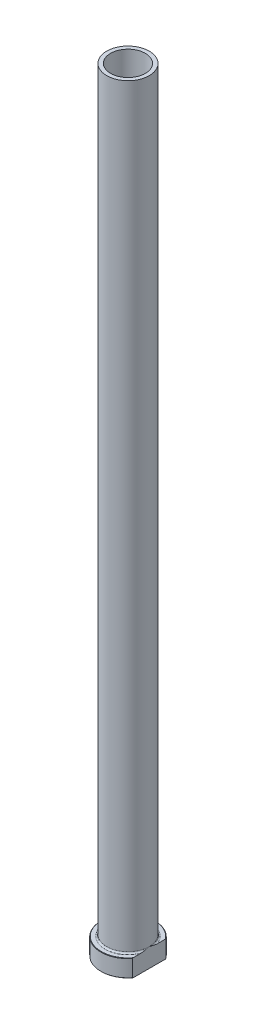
ISO-10303-21;
HEADER;
FILE_DESCRIPTION(('STEP AP214'),'2;1');
FILE_NAME('part.step','',(''),(''),'','','');
FILE_SCHEMA(('AUTOMOTIVE_DESIGN { 1 0 10303 214 1 1 1 1 }'));
ENDSEC;
DATA;
#1=APPLICATION_CONTEXT('core data for automotive mechanical design processes');
#2=APPLICATION_PROTOCOL_DEFINITION('international standard','automotive_design',2000,#1);
#3=PRODUCT_CONTEXT('',#1,'mechanical');
#4=PRODUCT('Part','Part','',(#3));
#5=PRODUCT_RELATED_PRODUCT_CATEGORY('part','',(#4));
#6=PRODUCT_DEFINITION_FORMATION('','',#4);
#7=PRODUCT_DEFINITION_CONTEXT('part definition',#1,'design');
#8=PRODUCT_DEFINITION('design','',#6,#7);
#9=PRODUCT_DEFINITION_SHAPE('','',#8);
#10=(LENGTH_UNIT() NAMED_UNIT(*) SI_UNIT(.MILLI.,.METRE.));
#11=(NAMED_UNIT(*) PLANE_ANGLE_UNIT() SI_UNIT($,.RADIAN.));
#12=(NAMED_UNIT(*) SI_UNIT($,.STERADIAN.) SOLID_ANGLE_UNIT());
#13=UNCERTAINTY_MEASURE_WITH_UNIT(LENGTH_MEASURE(1.E-05),#10,'distance_accuracy_value','');
#14=(GEOMETRIC_REPRESENTATION_CONTEXT(3) GLOBAL_UNCERTAINTY_ASSIGNED_CONTEXT((#13)) GLOBAL_UNIT_ASSIGNED_CONTEXT((#10,
#11,#12)) REPRESENTATION_CONTEXT('',''));
#15=CARTESIAN_POINT('',(0.,0.,0.));
#16=DIRECTION('',(0.,0.,1.));
#17=DIRECTION('',(1.,0.,0.));
#18=AXIS2_PLACEMENT_3D('',#15,#16,#17);
#19=CARTESIAN_POINT('',(0.,92.1876809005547,0.));
#20=DIRECTION('',(0.,1.,0.));
#21=DIRECTION('',(0.,0.,1.));
#22=AXIS2_PLACEMENT_3D('',#19,#20,#21);
#23=CYLINDRICAL_SURFACE('',#22,9.00000000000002);
#24=CARTESIAN_POINT('',(0.,400.,0.));
#25=DIRECTION('',(0.,1.,0.));
#26=DIRECTION('',(0.,0.,1.));
#27=AXIS2_PLACEMENT_3D('',#24,#25,#26);
#28=CIRCLE('',#27,9.00000000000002);
#29=CARTESIAN_POINT('',(0.,400.,9.00000000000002));
#30=VERTEX_POINT('',#29);
#31=EDGE_CURVE('E167',#30,#30,#28,.T.);
#32=ORIENTED_EDGE('',*,*,#31,.T.);
#33=EDGE_LOOP('',(#32));
#34=FACE_BOUND('',#33,.T.);
#35=CARTESIAN_POINT('',(0.,345.,0.));
#36=DIRECTION('',(0.,1.,0.));
#37=DIRECTION('',(0.,0.,1.));
#38=AXIS2_PLACEMENT_3D('',#35,#36,#37);
#39=CIRCLE('',#38,9.00000000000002);
#40=CARTESIAN_POINT('',(0.,345.,9.00000000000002));
#41=VERTEX_POINT('',#40);
#42=EDGE_CURVE('E170',#41,#41,#39,.T.);
#43=ORIENTED_EDGE('',*,*,#42,.F.);
#44=EDGE_LOOP('',(#43));
#45=FACE_BOUND('',#44,.T.);
#46=ADVANCED_FACE('F32',(#34,#45),#23,.F.);
#47=CARTESIAN_POINT('',(-9.00000000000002,400.,0.));
#48=DIRECTION('',(0.,1.,0.));
#49=DIRECTION('',(0.,0.,1.));
#50=AXIS2_PLACEMENT_3D('',#47,#48,#49);
#51=PLANE('',#50);
#52=CARTESIAN_POINT('',(0.,400.,0.));
#53=DIRECTION('',(0.,1.,0.));
#54=DIRECTION('',(0.,0.,1.));
#55=AXIS2_PLACEMENT_3D('',#52,#53,#54);
#56=CIRCLE('',#55,11.);
#57=CARTESIAN_POINT('',(0.,400.,11.));
#58=VERTEX_POINT('',#57);
#59=EDGE_CURVE('E174',#58,#58,#56,.T.);
#60=ORIENTED_EDGE('',*,*,#59,.T.);
#61=EDGE_LOOP('',(#60));
#62=FACE_BOUND('',#61,.T.);
#63=ORIENTED_EDGE('',*,*,#31,.F.);
#64=EDGE_LOOP('',(#63));
#65=FACE_BOUND('',#64,.T.);
#66=ADVANCED_FACE('F157',(#62,#65),#51,.T.);
#67=CARTESIAN_POINT('',(0.,92.1876809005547,0.));
#68=DIRECTION('',(0.,1.,0.));
#69=DIRECTION('',(0.,0.,1.));
#70=AXIS2_PLACEMENT_3D('',#67,#68,#69);
#71=CYLINDRICAL_SURFACE('',#70,11.);
#72=CARTESIAN_POINT('',(0.,9.8,0.));
#73=DIRECTION('',(0.,1.,0.));
#74=DIRECTION('',(0.,0.,1.));
#75=AXIS2_PLACEMENT_3D('',#72,#73,#74);
#76=CIRCLE('',#75,11.);
#77=CARTESIAN_POINT('',(11.,9.8,0.));
#78=VERTEX_POINT('',#77);
#79=EDGE_CURVE('E180',#78,#78,#76,.T.);
#80=ORIENTED_EDGE('',*,*,#79,.T.);
#81=EDGE_LOOP('',(#80));
#82=FACE_BOUND('',#81,.T.);
#83=ORIENTED_EDGE('',*,*,#59,.F.);
#84=EDGE_LOOP('',(#83));
#85=FACE_BOUND('',#84,.T.);
#86=ADVANCED_FACE('F162',(#82,#85),#71,.T.);
#87=CARTESIAN_POINT('',(-11.,9.,0.));
#88=DIRECTION('',(0.,1.,0.));
#89=DIRECTION('',(0.,0.,1.));
#90=AXIS2_PLACEMENT_3D('',#87,#88,#89);
#91=PLANE('',#90);
#92=DIRECTION('',(0.,0.,1.));
#93=VECTOR('',#92,1.);
#94=CARTESIAN_POINT('',(11.,9.,0.));
#95=LINE('',#94,#93);
#96=CARTESIAN_POINT('',(11.,9.,-8.33306666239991));
#97=VERTEX_POINT('',#96);
#98=CARTESIAN_POINT('',(11.,9.,-4.27083130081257));
#99=VERTEX_POINT('',#98);
#100=EDGE_CURVE('E54',#97,#99,#95,.T.);
#101=ORIENTED_EDGE('',*,*,#100,.F.);
#102=CARTESIAN_POINT('',(0.,9.,0.));
#103=DIRECTION('',(0.,1.,0.));
#104=DIRECTION('',(0.,0.,1.));
#105=AXIS2_PLACEMENT_3D('',#102,#103,#104);
#106=CIRCLE('',#105,13.8);
#107=CARTESIAN_POINT('',(11.,9.,8.33306666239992));
#108=VERTEX_POINT('',#107);
#109=EDGE_CURVE('E186',#97,#108,#106,.T.);
#110=ORIENTED_EDGE('',*,*,#109,.T.);
#111=CARTESIAN_POINT('',(11.,9.,4.27083130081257));
#112=VERTEX_POINT('',#111);
#113=EDGE_CURVE('E134',#112,#108,#95,.T.);
#114=ORIENTED_EDGE('',*,*,#113,.F.);
#115=CARTESIAN_POINT('',(0.,9.,0.));
#116=DIRECTION('',(0.,1.,0.));
#117=DIRECTION('',(0.,0.,1.));
#118=AXIS2_PLACEMENT_3D('',#115,#116,#117);
#119=CIRCLE('',#118,11.8);
#120=EDGE_CURVE('E183',#112,#99,#119,.F.);
#121=ORIENTED_EDGE('',*,*,#120,.T.);
#122=EDGE_LOOP('',(#101,#110,#114,#121));
#123=FACE_BOUND('',#122,.T.);
#124=ADVANCED_FACE('F197',(#123),#91,.T.);
#125=CARTESIAN_POINT('',(0.,92.1876809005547,0.));
#126=DIRECTION('',(0.,1.,0.));
#127=DIRECTION('',(0.,0.,1.));
#128=AXIS2_PLACEMENT_3D('',#125,#126,#127);
#129=CYLINDRICAL_SURFACE('',#128,14.);
#130=DIRECTION('',(0.,-1.,0.));
#131=VECTOR('',#130,1.);
#132=CARTESIAN_POINT('',(11.,400.,8.66025403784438));
#133=LINE('',#132,#131);
#134=CARTESIAN_POINT('',(11.,8.80000000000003,8.66025403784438));
#135=VERTEX_POINT('',#134);
#136=CARTESIAN_POINT('',(11.,0.200000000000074,8.66025403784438));
#137=VERTEX_POINT('',#136);
#138=EDGE_CURVE('E82',#135,#137,#133,.T.);
#139=ORIENTED_EDGE('',*,*,#138,.F.);
#140=CARTESIAN_POINT('',(0.,8.80000000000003,0.));
#141=DIRECTION('',(0.,1.,0.));
#142=DIRECTION('',(0.,0.,1.));
#143=AXIS2_PLACEMENT_3D('',#140,#141,#142);
#144=CIRCLE('',#143,14.);
#145=CARTESIAN_POINT('',(11.,8.80000000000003,-8.66025403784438));
#146=VERTEX_POINT('',#145);
#147=EDGE_CURVE('E95',#135,#146,#144,.F.);
#148=ORIENTED_EDGE('',*,*,#147,.T.);
#149=DIRECTION('',(0.,-1.,0.));
#150=VECTOR('',#149,1.);
#151=CARTESIAN_POINT('',(11.,400.,-8.66025403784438));
#152=LINE('',#151,#150);
#153=CARTESIAN_POINT('',(11.,0.200000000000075,-8.66025403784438));
#154=VERTEX_POINT('',#153);
#155=EDGE_CURVE('E192',#146,#154,#152,.T.);
#156=ORIENTED_EDGE('',*,*,#155,.T.);
#157=CARTESIAN_POINT('',(0.,0.200000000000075,0.));
#158=DIRECTION('',(0.,-1.,0.));
#159=DIRECTION('',(0.,0.,-1.));
#160=AXIS2_PLACEMENT_3D('',#157,#158,#159);
#161=CIRCLE('',#160,14.);
#162=EDGE_CURVE('E98',#154,#137,#161,.F.);
#163=ORIENTED_EDGE('',*,*,#162,.T.);
#164=EDGE_LOOP('',(#139,#148,#156,#163));
#165=FACE_BOUND('',#164,.T.);
#166=ADVANCED_FACE('F190',(#165),#129,.T.);
#167=CARTESIAN_POINT('',(-14.,0.,0.));
#168=DIRECTION('',(0.,-1.,0.));
#169=DIRECTION('',(0.,0.,-1.));
#170=AXIS2_PLACEMENT_3D('',#167,#168,#169);
#171=PLANE('',#170);
#172=CARTESIAN_POINT('',(0.,0.,0.));
#173=DIRECTION('',(0.,-1.,0.));
#174=DIRECTION('',(0.,0.,-1.));
#175=AXIS2_PLACEMENT_3D('',#172,#173,#174);
#176=CIRCLE('',#175,9.74999999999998);
#177=CARTESIAN_POINT('',(0.,0.,-9.74999999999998));
#178=VERTEX_POINT('',#177);
#179=EDGE_CURVE('E40',#178,#178,#176,.F.);
#180=ORIENTED_EDGE('',*,*,#179,.T.);
#181=EDGE_LOOP('',(#180));
#182=FACE_BOUND('',#181,.T.);
#183=DIRECTION('',(0.,0.,-1.));
#184=VECTOR('',#183,1.);
#185=CARTESIAN_POINT('',(11.,0.,8.66025403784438));
#186=LINE('',#185,#184);
#187=CARTESIAN_POINT('',(11.,0.,8.33306666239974));
#188=VERTEX_POINT('',#187);
#189=CARTESIAN_POINT('',(11.,0.,-8.33306666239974));
#190=VERTEX_POINT('',#189);
#191=EDGE_CURVE('E47',#188,#190,#186,.T.);
#192=ORIENTED_EDGE('',*,*,#191,.F.);
#193=CARTESIAN_POINT('',(0.,0.,0.));
#194=DIRECTION('',(0.,-1.,0.));
#195=DIRECTION('',(0.,0.,-1.));
#196=AXIS2_PLACEMENT_3D('',#193,#194,#195);
#197=CIRCLE('',#196,13.7999999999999);
#198=EDGE_CURVE('E92',#188,#190,#197,.T.);
#199=ORIENTED_EDGE('',*,*,#198,.T.);
#200=EDGE_LOOP('',(#192,#199));
#201=FACE_BOUND('',#200,.T.);
#202=ADVANCED_FACE('F91',(#182,#201),#171,.T.);
#203=CARTESIAN_POINT('',(0.,92.1876809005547,0.));
#204=DIRECTION('',(0.,1.,0.));
#205=DIRECTION('',(0.,0.,1.));
#206=AXIS2_PLACEMENT_3D('',#203,#204,#205);
#207=CYLINDRICAL_SURFACE('',#206,9.25000000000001);
#208=CARTESIAN_POINT('',(0.,0.499999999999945,0.));
#209=DIRECTION('',(0.,-1.,0.));
#210=DIRECTION('',(0.,0.,-1.));
#211=AXIS2_PLACEMENT_3D('',#208,#209,#210);
#212=CIRCLE('',#211,9.25000000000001);
#213=CARTESIAN_POINT('',(0.,0.499999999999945,-9.25000000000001));
#214=VERTEX_POINT('',#213);
#215=EDGE_CURVE('E11',#214,#214,#212,.T.);
#216=ORIENTED_EDGE('',*,*,#215,.T.);
#217=EDGE_LOOP('',(#216));
#218=FACE_BOUND('',#217,.T.);
#219=CARTESIAN_POINT('',(0.,333.,0.));
#220=DIRECTION('',(0.,1.,0.));
#221=DIRECTION('',(0.,0.,1.));
#222=AXIS2_PLACEMENT_3D('',#219,#220,#221);
#223=CIRCLE('',#222,9.25000000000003);
#224=CARTESIAN_POINT('',(0.,333.,9.25000000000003));
#225=VERTEX_POINT('',#224);
#226=EDGE_CURVE('E172',#225,#225,#223,.T.);
#227=ORIENTED_EDGE('',*,*,#226,.T.);
#228=EDGE_LOOP('',(#227));
#229=FACE_BOUND('',#228,.T.);
#230=ADVANCED_FACE('F215',(#218,#229),#207,.F.);
#231=CARTESIAN_POINT('',(0.,333.,0.));
#232=DIRECTION('',(0.,-1.,0.));
#233=DIRECTION('',(0.,0.,-1.));
#234=AXIS2_PLACEMENT_3D('',#231,#232,#233);
#235=CONICAL_SURFACE('',#234,9.25000000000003,0.0208303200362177);
#236=ORIENTED_EDGE('',*,*,#42,.T.);
#237=EDGE_LOOP('',(#236));
#238=FACE_BOUND('',#237,.T.);
#239=ORIENTED_EDGE('',*,*,#226,.F.);
#240=EDGE_LOOP('',(#239));
#241=FACE_BOUND('',#240,.T.);
#242=ADVANCED_FACE('F111',(#238,#241),#235,.F.);
#243=CARTESIAN_POINT('',(0.,9.8,0.));
#244=DIRECTION('',(0.,1.,0.));
#245=DIRECTION('',(0.,0.,1.));
#246=AXIS2_PLACEMENT_3D('',#243,#244,#245);
#247=TOROIDAL_SURFACE('',#246,11.8,0.8);
#248=ORIENTED_EDGE('',*,*,#120,.F.);
#249=CARTESIAN_POINT('',(11.,9.8,0.));
#250=CARTESIAN_POINT('',(11.,9.8000010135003,-1.16902482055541E-10));
#251=CARTESIAN_POINT('',(11.,9.80000202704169,3.62636934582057E-07));
#252=CARTESIAN_POINT('',(11.,9.80000392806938,1.38767107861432E-06));
#253=CARTESIAN_POINT('',(11.,9.80000479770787,2.0726385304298E-06));
#254=CARTESIAN_POINT('',(11.,9.80000659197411,3.71036788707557E-06));
#255=CARTESIAN_POINT('',(11.,9.80000749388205,4.68930350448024E-06));
#256=CARTESIAN_POINT('',(11.,9.80000912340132,6.73011731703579E-06));
#257=CARTESIAN_POINT('',(11.,9.80000985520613,7.78888300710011E-06));
#258=CARTESIAN_POINT('',(11.,9.80001253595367,1.18457679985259E-05));
#259=CARTESIAN_POINT('',(11.,9.80001433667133,1.49465101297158E-05));
#260=CARTESIAN_POINT('',(11.,9.8000173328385,2.11226793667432E-05));
#261=CARTESIAN_POINT('',(11.,9.80001856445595,2.4181339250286E-05));
#262=CARTESIAN_POINT('',(11.,9.80002366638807,3.70013808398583E-05));
#263=CARTESIAN_POINT('',(11.,9.80002742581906,4.68141787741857E-05));
#264=CARTESIAN_POINT('',(11.,9.80003302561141,6.5442575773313E-05));
#265=CARTESIAN_POINT('',(11.,9.80003506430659,7.41984170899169E-05));
#266=CARTESIAN_POINT('',(11.,9.80004981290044,0.000138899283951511));
#267=CARTESIAN_POINT('',(11.,9.80006088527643,0.000195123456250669));
#268=CARTESIAN_POINT('',(11.,9.80010935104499,0.000417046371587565));
#269=CARTESIAN_POINT('',(11.,9.8001557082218,0.00058074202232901));
#270=CARTESIAN_POINT('',(11.,9.80033600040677,0.00122860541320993));
#271=CARTESIAN_POINT('',(11.,9.80046404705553,0.00171390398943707));
#272=CARTESIAN_POINT('',(11.,9.8009765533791,0.00364143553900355));
#273=CARTESIAN_POINT('',(11.,9.80136837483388,0.00508221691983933));
#274=CARTESIAN_POINT('',(11.,9.80300002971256,0.0110983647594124));
#275=CARTESIAN_POINT('',(11.,9.80423069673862,0.0156755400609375));
#276=CARTESIAN_POINT('',(10.9999999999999,9.82474721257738,0.0919599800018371));
#277=CARTESIAN_POINT('',(11.,9.84411511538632,0.163651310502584));
#278=CARTESIAN_POINT('',(11.,9.88193435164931,0.304144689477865));
#279=CARTESIAN_POINT('',(11.,9.90039088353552,0.372945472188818));
#280=CARTESIAN_POINT('',(11.,9.9395315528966,0.519420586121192));
#281=CARTESIAN_POINT('',(11.,9.96019740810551,0.597099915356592));
#282=CARTESIAN_POINT('',(11.,10.0014716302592,0.753402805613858));
#283=CARTESIAN_POINT('',(11.,10.0220767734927,0.832027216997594));
#284=CARTESIAN_POINT('',(11.,10.0569012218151,0.966276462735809));
#285=CARTESIAN_POINT('',(11.,10.0712190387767,1.02187571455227));
#286=CARTESIAN_POINT('',(11.,10.0995828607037,1.13298938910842));
#287=CARTESIAN_POINT('',(11.,10.113629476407,1.1885036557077));
#288=CARTESIAN_POINT('',(11.,10.1546367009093,1.35225812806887));
#289=CARTESIAN_POINT('',(11.,10.1812165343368,1.46059357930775));
#290=CARTESIAN_POINT('',(11.,10.2669117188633,1.81933910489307));
#291=CARTESIAN_POINT('',(11.,10.3231642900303,2.07044657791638));
#292=CARTESIAN_POINT('',(11.,10.4250125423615,2.57779828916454));
#293=CARTESIAN_POINT('',(11.,10.470483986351,2.83406864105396));
#294=CARTESIAN_POINT('',(11.,10.5272211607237,3.23096220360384));
#295=CARTESIAN_POINT('',(11.,10.5446090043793,3.37070252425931));
#296=CARTESIAN_POINT('',(11.,10.5730475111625,3.65081430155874));
#297=CARTESIAN_POINT('',(11.,10.5840998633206,3.79118557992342));
#298=CARTESIAN_POINT('',(11.,10.5982304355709,4.07161741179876));
#299=CARTESIAN_POINT('',(11.,10.6013499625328,4.211675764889));
#300=CARTESIAN_POINT('',(11.,10.5975625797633,4.49161919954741));
#301=CARTESIAN_POINT('',(11.,10.5906655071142,4.63150431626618));
#302=CARTESIAN_POINT('',(11.,10.5704363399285,4.83931097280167));
#303=CARTESIAN_POINT('',(11.,10.5621463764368,4.90772588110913));
#304=CARTESIAN_POINT('',(11.,10.5417448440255,5.04405523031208));
#305=CARTESIAN_POINT('',(11.,10.5296301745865,5.11196921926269));
#306=CARTESIAN_POINT('',(11.,10.5009997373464,5.24610291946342));
#307=CARTESIAN_POINT('',(11.,10.4845340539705,5.31233305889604));
#308=CARTESIAN_POINT('',(11.,10.4461783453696,5.44314716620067));
#309=CARTESIAN_POINT('',(11.,10.4242944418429,5.50773290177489));
#310=CARTESIAN_POINT('',(11.,10.3734211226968,5.63494480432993));
#311=CARTESIAN_POINT('',(11.,10.3443615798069,5.69754429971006));
#312=CARTESIAN_POINT('',(11.,10.2940125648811,5.78758577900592));
#313=CARTESIAN_POINT('',(11.,10.276124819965,5.81692841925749));
#314=CARTESIAN_POINT('',(11.,10.2377448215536,5.87384301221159));
#315=CARTESIAN_POINT('',(11.,10.2172553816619,5.90141683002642));
#316=CARTESIAN_POINT('',(11.,10.1754926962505,5.95144540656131));
#317=CARTESIAN_POINT('',(11.,10.1545053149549,5.97413611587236));
#318=CARTESIAN_POINT('',(11.,10.1098178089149,6.01675330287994));
#319=CARTESIAN_POINT('',(11.,10.0861159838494,6.03667803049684));
#320=CARTESIAN_POINT('',(11.,10.0355211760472,6.07288913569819));
#321=CARTESIAN_POINT('',(11.,10.0085887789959,6.08912169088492));
#322=CARTESIAN_POINT('',(11.,9.95208821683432,6.11604527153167));
#323=CARTESIAN_POINT('',(11.,9.92252876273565,6.12675386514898));
#324=CARTESIAN_POINT('',(11.,9.87044933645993,6.13915978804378));
#325=CARTESIAN_POINT('',(11.,9.84833164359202,6.14255775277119));
#326=CARTESIAN_POINT('',(11.,9.80383923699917,6.14553082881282));
#327=CARTESIAN_POINT('',(11.,9.78146463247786,6.14510750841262));
#328=CARTESIAN_POINT('',(11.,9.73715415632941,6.14047859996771));
#329=CARTESIAN_POINT('',(11.,9.71521765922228,6.13627886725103));
#330=CARTESIAN_POINT('',(11.,9.67228934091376,6.12446633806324));
#331=CARTESIAN_POINT('',(11.,9.65129820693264,6.11685110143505));
#332=CARTESIAN_POINT('',(11.,9.60293880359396,6.09531376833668));
#333=CARTESIAN_POINT('',(11.,9.5761497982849,6.08009633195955));
#334=CARTESIAN_POINT('',(11.,9.52533680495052,6.04559207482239));
#335=CARTESIAN_POINT('',(11.,9.50131971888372,6.02629542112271));
#336=CARTESIAN_POINT('',(11.,9.44252607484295,5.97248581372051));
#337=CARTESIAN_POINT('',(11.,9.40981527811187,5.93573547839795));
#338=CARTESIAN_POINT('',(11.,9.35019076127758,5.85789950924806));
#339=CARTESIAN_POINT('',(11.,9.32328591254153,5.81680738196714));
#340=CARTESIAN_POINT('',(11.,9.27531247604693,5.73382009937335));
#341=CARTESIAN_POINT('',(11.,9.25403723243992,5.69204233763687));
#342=CARTESIAN_POINT('',(11.,9.21507165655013,5.60682590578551));
#343=CARTESIAN_POINT('',(11.,9.19738479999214,5.5633856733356));
#344=CARTESIAN_POINT('',(11.,9.16492416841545,5.47505507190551));
#345=CARTESIAN_POINT('',(11.,9.15017444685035,5.43015597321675));
#346=CARTESIAN_POINT('',(11.,9.12332484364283,5.33960740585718));
#347=CARTESIAN_POINT('',(11.,9.1112236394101,5.29395832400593));
#348=CARTESIAN_POINT('',(11.,9.08512909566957,5.18461425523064));
#349=CARTESIAN_POINT('',(11.,9.07217244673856,5.12067246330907));
#350=CARTESIAN_POINT('',(11.,9.04991113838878,4.99214785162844));
#351=CARTESIAN_POINT('',(11.,9.04060805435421,4.92756476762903));
#352=CARTESIAN_POINT('',(11.,9.01731839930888,4.73294213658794));
#353=CARTESIAN_POINT('',(11.,9.00801869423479,4.60233754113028));
#354=CARTESIAN_POINT('',(11.,8.99902947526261,4.34550193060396));
#355=CARTESIAN_POINT('',(11.,8.99901276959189,4.21927902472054));
#356=CARTESIAN_POINT('',(11.,9.00595929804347,3.96771196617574));
#357=CARTESIAN_POINT('',(11.,9.01288556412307,3.84236670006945));
#358=CARTESIAN_POINT('',(11.,9.03307410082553,3.58284783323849));
#359=CARTESIAN_POINT('',(11.,9.04676832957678,3.4487092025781));
#360=CARTESIAN_POINT('',(11.,9.07939011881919,3.18114709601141));
#361=CARTESIAN_POINT('',(11.,9.09831526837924,3.04772331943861));
#362=CARTESIAN_POINT('',(11.,9.1409202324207,2.77842123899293));
#363=CARTESIAN_POINT('',(11.,9.16470161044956,2.64255921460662));
#364=CARTESIAN_POINT('',(11.,9.21593088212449,2.37116504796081));
#365=CARTESIAN_POINT('',(11.,9.24338827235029,2.23563471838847));
#366=CARTESIAN_POINT('',(11.,9.31183649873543,1.91532204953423));
#367=CARTESIAN_POINT('',(11.,9.35408384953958,1.73080986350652));
#368=CARTESIAN_POINT('',(11.,9.44184141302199,1.36477440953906));
#369=CARTESIAN_POINT('',(11.,9.48730948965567,1.18324089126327));
#370=CARTESIAN_POINT('',(11.,9.55452451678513,0.921934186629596));
#371=CARTESIAN_POINT('',(11.,9.57534575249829,0.84192032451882));
#372=CARTESIAN_POINT('',(11.,9.61742284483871,0.681633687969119));
#373=CARTESIAN_POINT('',(11.,9.63868020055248,0.601361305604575));
#374=CARTESIAN_POINT('',(11.,9.68246779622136,0.436916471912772));
#375=CARTESIAN_POINT('',(11.,9.70500908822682,0.352747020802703));
#376=CARTESIAN_POINT('',(11.,9.74991333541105,0.185809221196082));
#377=CARTESIAN_POINT('',(10.9999999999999,9.77227331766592,0.103040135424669));
#378=CARTESIAN_POINT('',(11.,9.79577053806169,0.0156708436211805));
#379=CARTESIAN_POINT('',(11.,9.79700248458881,0.011088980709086));
#380=CARTESIAN_POINT('',(11.,9.79863444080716,0.00507176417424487));
#381=CARTESIAN_POINT('',(11.,9.79902527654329,0.00363459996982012));
#382=CARTESIAN_POINT('',(11.,9.79953658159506,0.00171158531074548));
#383=CARTESIAN_POINT('',(11.,9.799664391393,0.0012271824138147));
#384=CARTESIAN_POINT('',(11.,9.79984439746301,0.000580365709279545));
#385=CARTESIAN_POINT('',(11.,9.79989071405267,0.000416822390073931));
#386=CARTESIAN_POINT('',(11.,9.79993914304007,0.000195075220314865));
#387=CARTESIAN_POINT('',(11.,9.79995021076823,0.00013887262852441));
#388=CARTESIAN_POINT('',(11.,9.79996494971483,7.41937295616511E-05));
#389=CARTESIAN_POINT('',(11.,9.79996698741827,6.543910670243E-05));
#390=CARTESIAN_POINT('',(11.,9.79997258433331,4.68131905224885E-05));
#391=CARTESIAN_POINT('',(11.,9.79997634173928,3.70015903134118E-05));
#392=CARTESIAN_POINT('',(11.,9.79998144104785,2.41827848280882E-05));
#393=CARTESIAN_POINT('',(11.,9.79998267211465,2.11242161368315E-05));
#394=CARTESIAN_POINT('',(11.,9.79998566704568,1.49481369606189E-05));
#395=CARTESIAN_POINT('',(11.,9.79998746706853,1.18473826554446E-05));
#396=CARTESIAN_POINT('',(11.,9.79999014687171,7.79037338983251E-06));
#397=CARTESIAN_POINT('',(11.,9.79999087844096,6.73154556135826E-06));
#398=CARTESIAN_POINT('',(11.,9.799992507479,4.69056495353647E-06));
#399=CARTESIAN_POINT('',(11.,9.79999340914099,3.71152327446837E-06));
#400=CARTESIAN_POINT('',(11.,9.79999520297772,2.07354383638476E-06));
#401=CARTESIAN_POINT('',(11.,9.79999607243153,1.3884414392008E-06));
#402=CARTESIAN_POINT('',(11.,9.79999797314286,3.63067896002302E-07));
#403=CARTESIAN_POINT('',(11.,9.79999898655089,1.1690098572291E-10));
#404=CARTESIAN_POINT('',(11.,9.8,0.));
#405=B_SPLINE_CURVE_WITH_KNOTS('',3,(#249,#250,#251,#252,#253,#254,#255,#256,#257,#258,#259,
#260,#261,#262,#263,#264,#265,#266,#267,#268,#269,#270,#271,#272,#273,#274,#275,#276,#277,#278,
#279,#280,#281,#282,#283,#284,#285,#286,#287,#288,#289,#290,#291,#292,#293,#294,#295,#296,#297,
#298,#299,#300,#301,#302,#303,#304,#305,#306,#307,#308,#309,#310,#311,#312,#313,#314,#315,#316,
#317,#318,#319,#320,#321,#322,#323,#324,#325,#326,#327,#328,#329,#330,#331,#332,#333,#334,#335,
#336,#337,#338,#339,#340,#341,#342,#343,#344,#345,#346,#347,#348,#349,#350,#351,#352,#353,#354,
#355,#356,#357,#358,#359,#360,#361,#362,#363,#364,#365,#366,#367,#368,#369,#370,#371,#372,#373,
#374,#375,#376,#377,#378,#379,#380,#381,#382,#383,#384,#385,#386,#387,#388,#389,#390,#391,#392,
#393,#394,#395,#396,#397,#398,#399,#400,#401,#402,#403,#404),.UNSPECIFIED.,.T.,.F.,(4,2,2,2,2,2,
2,2,2,2,2,2,2,2,2,2,2,2,2,2,2,2,2,2,2,2,2,2,2,2,2,2,2,2,2,2,2,2,2,2,2,2,2,2,2,2,2,2,2,2,2,2,2,2,
2,2,2,2,2,2,2,2,2,2,2,2,2,2,2,2,2,2,2,2,2,2,2,4),(0.,3.06075700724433E-06,6.37972807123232E-06,
1.03502574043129E-05,1.42089605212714E-05,2.4925242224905E-05,3.48085374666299E-05,
6.62739221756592E-05,9.32104220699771E-05,0.000265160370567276,0.000775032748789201,
0.00228129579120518,0.0067599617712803,0.0209798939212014,0.243756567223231,0.457458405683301,
0.698601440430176,0.942439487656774,1.11467870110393,1.28646938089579,1.62111125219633,
2.39296447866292,3.1733213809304,3.59566656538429,4.01789910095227,4.43792849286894,
4.85754566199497,5.06420795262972,5.2710382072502,5.47558418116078,5.6799000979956,
5.8862978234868,5.98928489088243,6.09216151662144,6.18469603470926,6.27728883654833,
6.37115541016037,6.46472158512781,6.5315494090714,6.59834980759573,6.66504681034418,
6.73179153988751,6.8236989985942,6.91583057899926,7.06259901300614,7.20959014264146,
7.35003074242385,7.49060673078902,7.63229046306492,7.7739032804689,7.96948934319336,
8.16515964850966,8.5574426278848,8.93589815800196,9.31234923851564,9.71673016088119,
10.1209250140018,10.5346477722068,10.9494607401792,11.5172595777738,12.0786596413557,
12.326695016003,12.5758117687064,12.8372206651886,13.0944202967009,13.108654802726,
13.1131222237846,13.1146257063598,13.1151351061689,13.1153069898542,13.1153339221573,
13.1153653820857,13.1153752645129,13.1153859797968,13.115389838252,13.1153938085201,
13.1153971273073,13.1154001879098),.UNSPECIFIED.);
#406=EDGE_CURVE('E126',#112,#78,#405,.T.);
#407=ORIENTED_EDGE('',*,*,#406,.T.);
#408=ORIENTED_EDGE('',*,*,#79,.F.);
#409=CARTESIAN_POINT('',(11.,9.8,0.));
#410=CARTESIAN_POINT('',(11.,9.79999898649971,1.16906501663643E-10));
#411=CARTESIAN_POINT('',(11.,9.79999797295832,-3.62636930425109E-07));
#412=CARTESIAN_POINT('',(11.,9.79999607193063,-1.3876710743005E-06));
#413=CARTESIAN_POINT('',(11.,9.79999520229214,-2.07263852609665E-06));
#414=CARTESIAN_POINT('',(11.,9.7999934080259,-3.71036788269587E-06));
#415=CARTESIAN_POINT('',(11.,9.79999250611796,-4.68930350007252E-06));
#416=CARTESIAN_POINT('',(11.,9.79999087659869,-6.7301173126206E-06));
#417=CARTESIAN_POINT('',(11.,9.79999014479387,-7.78888300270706E-06));
#418=CARTESIAN_POINT('',(11.,9.79998746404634,-1.18457679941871E-05));
#419=CARTESIAN_POINT('',(11.,9.79998566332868,-1.49465101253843E-05));
#420=CARTESIAN_POINT('',(11.,9.7999826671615,-2.1122679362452E-05));
#421=CARTESIAN_POINT('',(11.,9.79998143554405,-2.41813392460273E-05));
#422=CARTESIAN_POINT('',(11.,9.79997633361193,-3.70013808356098E-05));
#423=CARTESIAN_POINT('',(11.,9.79997257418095,-4.68141787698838E-05));
#424=CARTESIAN_POINT('',(11.,9.7999669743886,-6.54425757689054E-05));
#425=CARTESIAN_POINT('',(11.,9.79996493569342,-7.41984170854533E-05));
#426=CARTESIAN_POINT('',(11.,9.79995018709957,-0.000138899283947));
#427=CARTESIAN_POINT('',(11.,9.79993911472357,-0.000195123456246));
#428=CARTESIAN_POINT('',(11.,9.79989064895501,-0.00041704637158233));
#429=CARTESIAN_POINT('',(11.,9.79984429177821,-0.00058074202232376));
#430=CARTESIAN_POINT('',(11.,9.79966399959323,-0.0012286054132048));
#431=CARTESIAN_POINT('',(11.,9.79953595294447,-0.00171390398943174));
#432=CARTESIAN_POINT('',(11.,9.7990234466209,-0.00364143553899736));
#433=CARTESIAN_POINT('',(11.,9.79863162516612,-0.00508221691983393));
#434=CARTESIAN_POINT('',(11.,9.79699997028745,-0.0110983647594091));
#435=CARTESIAN_POINT('',(11.,9.79576930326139,-0.0156755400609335));
#436=CARTESIAN_POINT('',(10.9999999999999,9.77525278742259,-0.0919599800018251));
#437=CARTESIAN_POINT('',(11.,9.75588488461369,-0.163651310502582));
#438=CARTESIAN_POINT('',(11.,9.71806564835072,-0.304144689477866));
#439=CARTESIAN_POINT('',(11.,9.6996091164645,-0.372945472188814));
#440=CARTESIAN_POINT('',(11.,9.6604684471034,-0.519420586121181));
#441=CARTESIAN_POINT('',(11.,9.63980259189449,-0.59709991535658));
#442=CARTESIAN_POINT('',(11.,9.59852836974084,-0.75340280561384));
#443=CARTESIAN_POINT('',(11.,9.57792322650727,-0.832027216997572));
#444=CARTESIAN_POINT('',(11.,9.54309877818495,-0.966276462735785));
#445=CARTESIAN_POINT('',(11.,9.52878096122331,-1.02187571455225));
#446=CARTESIAN_POINT('',(11.,9.50041713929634,-1.1329893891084));
#447=CARTESIAN_POINT('',(11.,9.48637052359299,-1.18850365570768));
#448=CARTESIAN_POINT('',(11.,9.44536329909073,-1.35225812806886));
#449=CARTESIAN_POINT('',(11.,9.41878346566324,-1.46059357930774));
#450=CARTESIAN_POINT('',(11.,9.33308828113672,-1.81933910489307));
#451=CARTESIAN_POINT('',(11.,9.27683570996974,-2.07044657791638));
#452=CARTESIAN_POINT('',(11.,9.17498745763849,-2.57779828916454));
#453=CARTESIAN_POINT('',(11.,9.12951601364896,-2.83406864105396));
#454=CARTESIAN_POINT('',(11.,9.07277883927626,-3.23096220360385));
#455=CARTESIAN_POINT('',(11.,9.0553909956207,-3.37070252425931));
#456=CARTESIAN_POINT('',(11.,9.02695248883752,-3.65081430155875));
#457=CARTESIAN_POINT('',(11.,9.01590013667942,-3.79118557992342));
#458=CARTESIAN_POINT('',(11.,9.00176956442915,-4.07161741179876));
#459=CARTESIAN_POINT('',(11.,8.99865003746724,-4.211675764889));
#460=CARTESIAN_POINT('',(11.,9.00243742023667,-4.49161919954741));
#461=CARTESIAN_POINT('',(11.,9.00933449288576,-4.63150431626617));
#462=CARTESIAN_POINT('',(11.,9.02956366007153,-4.83931097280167));
#463=CARTESIAN_POINT('',(11.,9.03785362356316,-4.90772588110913));
#464=CARTESIAN_POINT('',(11.,9.05825515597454,-5.04405523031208));
#465=CARTESIAN_POINT('',(11.,9.0703698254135,-5.11196921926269));
#466=CARTESIAN_POINT('',(11.,9.09900026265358,-5.24610291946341));
#467=CARTESIAN_POINT('',(11.,9.1154659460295,-5.31233305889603));
#468=CARTESIAN_POINT('',(11.,9.15382165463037,-5.44314716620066));
#469=CARTESIAN_POINT('',(11.,9.17570555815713,-5.50773290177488));
#470=CARTESIAN_POINT('',(11.,9.22657887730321,-5.63494480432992));
#471=CARTESIAN_POINT('',(11.,9.25563842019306,-5.69754429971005));
#472=CARTESIAN_POINT('',(11.,9.30598743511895,-5.78758577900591));
#473=CARTESIAN_POINT('',(11.,9.32387518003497,-5.81692841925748));
#474=CARTESIAN_POINT('',(11.,9.36225517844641,-5.87384301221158));
#475=CARTESIAN_POINT('',(11.,9.38274461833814,-5.90141683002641));
#476=CARTESIAN_POINT('',(11.,9.42450730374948,-5.95144540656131));
#477=CARTESIAN_POINT('',(11.,9.44549468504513,-5.97413611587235));
#478=CARTESIAN_POINT('',(11.,9.49018219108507,-6.01675330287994));
#479=CARTESIAN_POINT('',(11.,9.51388401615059,-6.03667803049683));
#480=CARTESIAN_POINT('',(11.,9.56447882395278,-6.07288913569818));
#481=CARTESIAN_POINT('',(11.,9.59141122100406,-6.08912169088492));
#482=CARTESIAN_POINT('',(11.,9.64791178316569,-6.11604527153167));
#483=CARTESIAN_POINT('',(11.,9.67747123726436,-6.12675386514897));
#484=CARTESIAN_POINT('',(11.,9.72955066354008,-6.13915978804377));
#485=CARTESIAN_POINT('',(11.,9.75166835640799,-6.14255775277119));
#486=CARTESIAN_POINT('',(11.,9.79616076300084,-6.14553082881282));
#487=CARTESIAN_POINT('',(11.,9.81853536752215,-6.14510750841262));
#488=CARTESIAN_POINT('',(11.,9.8628458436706,-6.14047859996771));
#489=CARTESIAN_POINT('',(11.,9.88478234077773,-6.13627886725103));
#490=CARTESIAN_POINT('',(11.,9.92771065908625,-6.12446633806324));
#491=CARTESIAN_POINT('',(11.,9.94870179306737,-6.11685110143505));
#492=CARTESIAN_POINT('',(11.,9.99706119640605,-6.09531376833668));
#493=CARTESIAN_POINT('',(11.,10.0238502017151,-6.08009633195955));
#494=CARTESIAN_POINT('',(11.,10.0746631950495,-6.04559207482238));
#495=CARTESIAN_POINT('',(11.,10.0986802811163,-6.0262954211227));
#496=CARTESIAN_POINT('',(11.,10.1574739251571,-5.9724858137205));
#497=CARTESIAN_POINT('',(11.,10.1901847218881,-5.93573547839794));
#498=CARTESIAN_POINT('',(11.,10.2498092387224,-5.85789950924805));
#499=CARTESIAN_POINT('',(11.,10.2767140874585,-5.81680738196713));
#500=CARTESIAN_POINT('',(11.,10.3246875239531,-5.73382009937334));
#501=CARTESIAN_POINT('',(11.,10.3459627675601,-5.69204233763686));
#502=CARTESIAN_POINT('',(11.,10.3849283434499,-5.6068259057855));
#503=CARTESIAN_POINT('',(11.,10.4026152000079,-5.56338567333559));
#504=CARTESIAN_POINT('',(11.,10.4350758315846,-5.4750550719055));
#505=CARTESIAN_POINT('',(11.,10.4498255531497,-5.43015597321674));
#506=CARTESIAN_POINT('',(11.,10.4766751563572,-5.33960740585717));
#507=CARTESIAN_POINT('',(11.,10.4887763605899,-5.29395832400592));
#508=CARTESIAN_POINT('',(11.,10.5148709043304,-5.18461425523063));
#509=CARTESIAN_POINT('',(11.,10.5278275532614,-5.12067246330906));
#510=CARTESIAN_POINT('',(11.,10.5500888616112,-4.99214785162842));
#511=CARTESIAN_POINT('',(11.,10.5593919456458,-4.92756476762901));
#512=CARTESIAN_POINT('',(11.,10.5826816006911,-4.73294213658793));
#513=CARTESIAN_POINT('',(11.,10.5919813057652,-4.60233754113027));
#514=CARTESIAN_POINT('',(11.,10.6009705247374,-4.34550193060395));
#515=CARTESIAN_POINT('',(11.,10.6009872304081,-4.21927902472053));
#516=CARTESIAN_POINT('',(11.,10.5940407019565,-3.96771196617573));
#517=CARTESIAN_POINT('',(11.,10.5871144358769,-3.84236670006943));
#518=CARTESIAN_POINT('',(11.,10.5669258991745,-3.58284783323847));
#519=CARTESIAN_POINT('',(11.,10.5532316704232,-3.44870920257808));
#520=CARTESIAN_POINT('',(11.,10.5206098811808,-3.18114709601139));
#521=CARTESIAN_POINT('',(11.,10.5016847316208,-3.04772331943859));
#522=CARTESIAN_POINT('',(11.,10.4590797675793,-2.77842123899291));
#523=CARTESIAN_POINT('',(11.,10.4352983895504,-2.6425592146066));
#524=CARTESIAN_POINT('',(11.,10.3840691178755,-2.37116504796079));
#525=CARTESIAN_POINT('',(11.,10.3566117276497,-2.23563471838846));
#526=CARTESIAN_POINT('',(11.,10.2881635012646,-1.91532204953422));
#527=CARTESIAN_POINT('',(11.,10.2459161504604,-1.73080986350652));
#528=CARTESIAN_POINT('',(11.,10.158158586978,-1.36477440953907));
#529=CARTESIAN_POINT('',(11.,10.1126905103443,-1.18324089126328));
#530=CARTESIAN_POINT('',(11.,10.0454754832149,-0.921934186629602));
#531=CARTESIAN_POINT('',(11.,10.0246542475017,-0.841920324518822));
#532=CARTESIAN_POINT('',(11.,9.9825771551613,-0.681633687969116));
#533=CARTESIAN_POINT('',(11.,9.96131979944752,-0.601361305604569));
#534=CARTESIAN_POINT('',(11.,9.91753220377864,-0.436916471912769));
#535=CARTESIAN_POINT('',(11.,9.89499091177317,-0.352747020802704));
#536=CARTESIAN_POINT('',(10.9999999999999,9.85008666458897,-0.185809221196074));
#537=CARTESIAN_POINT('',(10.9999999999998,9.82772668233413,-0.103040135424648));
#538=CARTESIAN_POINT('',(11.,9.80422946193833,-0.0156708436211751));
#539=CARTESIAN_POINT('',(11.,9.8029975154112,-0.0110889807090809));
#540=CARTESIAN_POINT('',(11.,9.80136555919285,-0.00507176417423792));
#541=CARTESIAN_POINT('',(11.,9.80097472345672,-0.0036345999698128));
#542=CARTESIAN_POINT('',(11.,9.80046341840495,-0.00171158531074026));
#543=CARTESIAN_POINT('',(11.,9.80033560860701,-0.00122718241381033));
#544=CARTESIAN_POINT('',(11.,9.800155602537,-0.000580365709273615));
#545=CARTESIAN_POINT('',(11.,9.80010928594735,-0.000416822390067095));
#546=CARTESIAN_POINT('',(11.,9.80006085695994,-0.000195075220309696));
#547=CARTESIAN_POINT('',(11.,9.80004978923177,-0.000138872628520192));
#548=CARTESIAN_POINT('',(11.,9.80003505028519,-7.41937295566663E-05));
#549=CARTESIAN_POINT('',(11.,9.80003301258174,-6.54391066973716E-05));
#550=CARTESIAN_POINT('',(11.,9.8000274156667,-4.6813190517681E-05));
#551=CARTESIAN_POINT('',(11.,9.80002365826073,-3.70015903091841E-05));
#552=CARTESIAN_POINT('',(11.,9.80001855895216,-2.41827848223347E-05));
#553=CARTESIAN_POINT('',(11.,9.80001732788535,-2.11242161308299E-05));
#554=CARTESIAN_POINT('',(11.,9.80001433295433,-1.49481369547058E-05));
#555=CARTESIAN_POINT('',(11.,9.80001253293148,-1.1847382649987E-05));
#556=CARTESIAN_POINT('',(11.,9.8000098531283,-7.79037338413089E-06));
#557=CARTESIAN_POINT('',(11.,9.80000912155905,-6.73154555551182E-06));
#558=CARTESIAN_POINT('',(11.,9.80000749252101,-4.69056494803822E-06));
#559=CARTESIAN_POINT('',(11.,9.80000659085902,-3.71152326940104E-06));
#560=CARTESIAN_POINT('',(11.,9.80000479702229,-2.07354383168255E-06));
#561=CARTESIAN_POINT('',(11.,9.80000392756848,-1.3884414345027E-06));
#562=CARTESIAN_POINT('',(11.,9.80000202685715,-3.63067891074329E-07));
#563=CARTESIAN_POINT('',(11.,9.80000101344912,-1.16896191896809E-10));
#564=CARTESIAN_POINT('',(11.,9.8,0.));
#565=B_SPLINE_CURVE_WITH_KNOTS('',3,(#409,#410,#411,#412,#413,#414,#415,#416,#417,#418,#419,
#420,#421,#422,#423,#424,#425,#426,#427,#428,#429,#430,#431,#432,#433,#434,#435,#436,#437,#438,
#439,#440,#441,#442,#443,#444,#445,#446,#447,#448,#449,#450,#451,#452,#453,#454,#455,#456,#457,
#458,#459,#460,#461,#462,#463,#464,#465,#466,#467,#468,#469,#470,#471,#472,#473,#474,#475,#476,
#477,#478,#479,#480,#481,#482,#483,#484,#485,#486,#487,#488,#489,#490,#491,#492,#493,#494,#495,
#496,#497,#498,#499,#500,#501,#502,#503,#504,#505,#506,#507,#508,#509,#510,#511,#512,#513,#514,
#515,#516,#517,#518,#519,#520,#521,#522,#523,#524,#525,#526,#527,#528,#529,#530,#531,#532,#533,
#534,#535,#536,#537,#538,#539,#540,#541,#542,#543,#544,#545,#546,#547,#548,#549,#550,#551,#552,
#553,#554,#555,#556,#557,#558,#559,#560,#561,#562,#563,#564),.UNSPECIFIED.,.T.,.F.,(4,2,2,2,2,2,
2,2,2,2,2,2,2,2,2,2,2,2,2,2,2,2,2,2,2,2,2,2,2,2,2,2,2,2,2,2,2,2,2,2,2,2,2,2,2,2,2,2,2,2,2,2,2,2,
2,2,2,2,2,2,2,2,2,2,2,2,2,2,2,2,2,2,2,2,2,2,2,4),(0.,3.06075700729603E-06,6.37972807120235E-06,
1.03502574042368E-05,1.42089605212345E-05,2.49252422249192E-05,3.48085374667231E-05,
6.62739221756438E-05,9.32104220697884E-05,0.000265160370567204,0.000775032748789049,
0.0022812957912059,0.00675996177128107,0.0209798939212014,0.243756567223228,0.457458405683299,
0.698601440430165,0.942439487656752,1.11467870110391,1.28646938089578,1.62111125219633,
2.39296447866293,3.17332138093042,3.5956665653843,4.01789910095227,4.43792849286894,
4.85754566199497,5.06420795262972,5.2710382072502,5.47558418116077,5.67990009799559,
5.88629782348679,5.98928489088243,6.09216151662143,6.18469603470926,6.27728883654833,
6.37115541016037,6.46472158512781,6.53154940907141,6.59834980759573,6.66504681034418,
6.73179153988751,6.8236989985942,6.91583057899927,7.06259901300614,7.20959014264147,
7.35003074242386,7.49060673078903,7.63229046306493,7.77390328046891,7.96948934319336,
8.16515964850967,8.55744262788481,8.93589815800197,9.31234923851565,9.7167301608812,
10.1209250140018,10.5346477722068,10.9494607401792,11.5172595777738,12.0786596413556,
12.326695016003,12.5758117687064,12.8372206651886,13.0944202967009,13.108654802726,
13.1131222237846,13.1146257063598,13.1151351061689,13.1153069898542,13.1153339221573,
13.1153653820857,13.1153752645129,13.1153859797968,13.115389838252,13.1153938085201,
13.1153971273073,13.1154001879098),.UNSPECIFIED.);
#566=EDGE_CURVE('E135',#78,#99,#565,.T.);
#567=ORIENTED_EDGE('',*,*,#566,.T.);
#568=EDGE_LOOP('',(#248,#407,#408,#567));
#569=FACE_BOUND('',#568,.T.);
#570=ADVANCED_FACE('F141',(#569),#247,.F.);
#571=CARTESIAN_POINT('',(0.,8.99999999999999,0.));
#572=DIRECTION('',(0.,-1.,0.));
#573=DIRECTION('',(0.,0.,-1.));
#574=AXIS2_PLACEMENT_3D('',#571,#572,#573);
#575=CONICAL_SURFACE('',#574,13.8,0.785398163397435);
#576=CARTESIAN_POINT('',(11.,0.799226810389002,-19.0534516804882));
#577=CARTESIAN_POINT('',(11.,1.04353773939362,-18.7713380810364));
#578=CARTESIAN_POINT('',(11.,1.28708512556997,-18.4885613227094));
#579=CARTESIAN_POINT('',(11.,1.77243087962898,-17.9215029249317));
#580=CARTESIAN_POINT('',(11.,2.01422921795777,-17.6372212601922));
#581=CARTESIAN_POINT('',(11.,2.49596158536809,-17.0668479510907));
#582=CARTESIAN_POINT('',(11.,2.73589466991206,-16.7807555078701));
#583=CARTESIAN_POINT('',(11.,3.21348992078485,-16.2066860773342));
#584=CARTESIAN_POINT('',(11.,3.45115209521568,-15.9187090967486));
#585=CARTESIAN_POINT('',(11.,4.17136254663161,-15.0380400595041));
#586=CARTESIAN_POINT('',(11.,4.64980550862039,-14.4419631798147));
#587=CARTESIAN_POINT('',(11.,5.35642548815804,-13.5393158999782));
#588=CARTESIAN_POINT('',(11.,5.59010018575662,-13.2370444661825));
#589=CARTESIAN_POINT('',(11.,6.05311937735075,-12.6292064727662));
#590=CARTESIAN_POINT('',(11.,6.28246396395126,-12.3236399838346));
#591=CARTESIAN_POINT('',(11.,6.73635357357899,-11.7082856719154));
#592=CARTESIAN_POINT('',(11.,6.96089131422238,-11.3984924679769));
#593=CARTESIAN_POINT('',(11.,7.40382501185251,-10.7745304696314));
#594=CARTESIAN_POINT('',(11.,7.62222089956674,-10.4603616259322));
#595=CARTESIAN_POINT('',(11.,8.05178447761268,-9.82670701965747));
#596=CARTESIAN_POINT('',(11.,8.26294571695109,-9.50721687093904));
#597=CARTESIAN_POINT('',(11.,8.67621603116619,-8.86242246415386));
#598=CARTESIAN_POINT('',(11.,8.87832530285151,-8.53711833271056));
#599=CARTESIAN_POINT('',(11.,9.26987187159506,-7.88242741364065));
#600=CARTESIAN_POINT('',(11.,9.45939671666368,-7.55309323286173));
#601=CARTESIAN_POINT('',(11.,9.82494403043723,-6.88691791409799));
#602=CARTESIAN_POINT('',(11.,10.0009648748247,-6.55007587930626));
#603=CARTESIAN_POINT('',(11.,10.3359584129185,-5.86858126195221));
#604=CARTESIAN_POINT('',(11.,10.4949563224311,-5.52394117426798));
#605=CARTESIAN_POINT('',(11.,10.7921156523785,-4.82586409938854));
#606=CARTESIAN_POINT('',(11.,10.9302852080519,-4.47243060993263));
#607=CARTESIAN_POINT('',(11.,11.1840276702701,-3.74812634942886));
#608=CARTESIAN_POINT('',(11.,11.2989969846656,-3.37704109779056));
#609=CARTESIAN_POINT('',(11.,11.4966201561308,-2.62628112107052));
#610=CARTESIAN_POINT('',(11.,11.5792791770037,-2.24660777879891));
#611=CARTESIAN_POINT('',(11.,11.706794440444,-1.48318013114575));
#612=CARTESIAN_POINT('',(11.,11.7518742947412,-1.0994639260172));
#613=CARTESIAN_POINT('',(11.,11.8017732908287,-0.329400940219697));
#614=CARTESIAN_POINT('',(11.,11.8065963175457,0.056945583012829));
#615=CARTESIAN_POINT('',(11.,11.7755993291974,0.828327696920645));
#616=CARTESIAN_POINT('',(11.,11.7397415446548,1.21336173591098));
#617=CARTESIAN_POINT('',(11.,11.6300009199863,1.97793113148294));
#618=CARTESIAN_POINT('',(11.,11.5561107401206,2.35746541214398));
#619=CARTESIAN_POINT('',(11.,11.3744378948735,3.11099269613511));
#620=CARTESIAN_POINT('',(11.,11.2664224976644,3.48492860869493));
#621=CARTESIAN_POINT('',(11.,11.0222579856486,4.2233537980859));
#622=CARTESIAN_POINT('',(11.,10.8861087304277,4.58784302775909));
#623=CARTESIAN_POINT('',(11.,10.5561721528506,5.39220971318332));
#624=CARTESIAN_POINT('',(11.,10.356363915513,5.82959722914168));
#625=CARTESIAN_POINT('',(11.,9.93013458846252,6.69131959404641));
#626=CARTESIAN_POINT('',(11.,9.70369800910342,7.11564666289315));
#627=CARTESIAN_POINT('',(11.,9.23013828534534,7.9536694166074));
#628=CARTESIAN_POINT('',(11.,8.98297298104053,8.36734108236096));
#629=CARTESIAN_POINT('',(11.,8.47313346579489,9.18483098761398));
#630=CARTESIAN_POINT('',(11.,8.21046237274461,9.5886511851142));
#631=CARTESIAN_POINT('',(11.,7.67160592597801,10.3902243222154));
#632=CARTESIAN_POINT('',(11.,7.39535669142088,10.7879341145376));
#633=CARTESIAN_POINT('',(11.,6.83321127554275,11.5764739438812));
#634=CARTESIAN_POINT('',(11.,6.54731471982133,11.9673037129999));
#635=CARTESIAN_POINT('',(11.,5.96814835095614,12.742746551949));
#636=CARTESIAN_POINT('',(11.,5.67488737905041,13.1273662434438));
#637=CARTESIAN_POINT('',(11.,5.08213887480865,13.891753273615));
#638=CARTESIAN_POINT('',(11.,4.78265148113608,14.2715207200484));
#639=CARTESIAN_POINT('',(11.,4.18030013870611,15.0247813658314));
#640=CARTESIAN_POINT('',(11.,3.87746557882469,15.3982981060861));
#641=CARTESIAN_POINT('',(11.,3.26753649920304,16.1419438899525));
#642=CARTESIAN_POINT('',(11.,2.96044123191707,16.5120723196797));
#643=CARTESIAN_POINT('',(11.,2.34594437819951,17.2455248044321));
#644=CARTESIAN_POINT('',(11.,2.03857939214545,17.6088795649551));
#645=CARTESIAN_POINT('',(11.,1.42096006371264,18.332995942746));
#646=CARTESIAN_POINT('',(11.,1.11070633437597,18.6937580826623));
#647=CARTESIAN_POINT('',(11.,0.799226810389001,19.0534516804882));
#648=B_SPLINE_CURVE_WITH_KNOTS('',3,(#576,#577,#578,#579,#580,#581,#582,#583,#584,#585,#586,
#587,#588,#589,#590,#591,#592,#593,#594,#595,#596,#597,#598,#599,#600,#601,#602,#603,#604,#605,
#606,#607,#608,#609,#610,#611,#612,#613,#614,#615,#616,#617,#618,#619,#620,#621,#622,#623,#624,
#625,#626,#627,#628,#629,#630,#631,#632,#633,#634,#635,#636,#637,#638,#639,#640,#641,#642,#643,
#644,#645,#646,#647),.UNSPECIFIED.,.F.,.F.,(4,2,2,2,2,2,2,2,2,2,2,2,2,2,2,2,2,2,2,2,2,2,2,2,2,2,
2,2,2,2,2,2,2,2,2,4),(0.,1.11959123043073,2.23920133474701,3.35934562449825,4.47948591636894,
6.7722963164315,7.91845486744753,9.06458887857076,10.2123513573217,11.3601267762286,
12.5089003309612,13.6576488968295,14.7973159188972,15.9371198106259,17.0752112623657,
18.2128570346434,19.3770913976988,20.5411396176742,21.6982107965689,22.8551703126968,
24.0132048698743,25.1714629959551,26.3377973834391,27.5041375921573,28.9455042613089,
30.3877135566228,31.8329307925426,33.2778584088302,34.7303948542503,36.1829877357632,
37.6339130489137,39.0848060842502,40.5273412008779,41.9701326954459,43.397876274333,
44.8253234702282),.UNSPECIFIED.);
#649=EDGE_CURVE('E133',#146,#97,#648,.T.);
#650=ORIENTED_EDGE('',*,*,#649,.F.);
#651=ORIENTED_EDGE('',*,*,#147,.F.);
#652=EDGE_CURVE('E118',#108,#135,#648,.T.);
#653=ORIENTED_EDGE('',*,*,#652,.F.);
#654=ORIENTED_EDGE('',*,*,#109,.F.);
#655=EDGE_LOOP('',(#650,#651,#653,#654));
#656=FACE_BOUND('',#655,.T.);
#657=ADVANCED_FACE('F145',(#656),#575,.T.);
#658=CARTESIAN_POINT('',(0.,0.200000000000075,0.));
#659=DIRECTION('',(0.,1.,0.));
#660=DIRECTION('',(0.,0.,1.));
#661=AXIS2_PLACEMENT_3D('',#658,#659,#660);
#662=CONICAL_SURFACE('',#661,14.,0.785398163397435);
#663=CARTESIAN_POINT('',(11.,8.2007731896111,19.0534516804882));
#664=CARTESIAN_POINT('',(11.,7.95646226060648,18.7713380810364));
#665=CARTESIAN_POINT('',(11.,7.71291487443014,18.4885613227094));
#666=CARTESIAN_POINT('',(11.,7.22756912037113,17.9215029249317));
#667=CARTESIAN_POINT('',(11.,6.98577078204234,17.6372212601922));
#668=CARTESIAN_POINT('',(11.,6.50403841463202,17.0668479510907));
#669=CARTESIAN_POINT('',(11.,6.26410533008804,16.7807555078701));
#670=CARTESIAN_POINT('',(11.,5.78651007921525,16.2066860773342));
#671=CARTESIAN_POINT('',(11.,5.54884790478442,15.9187090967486));
#672=CARTESIAN_POINT('',(11.,4.8286374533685,15.0380400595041));
#673=CARTESIAN_POINT('',(11.,4.35019449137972,14.4419631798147));
#674=CARTESIAN_POINT('',(11.,3.64357451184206,13.5393158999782));
#675=CARTESIAN_POINT('',(11.,3.40989981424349,13.2370444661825));
#676=CARTESIAN_POINT('',(11.,2.94688062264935,12.6292064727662));
#677=CARTESIAN_POINT('',(11.,2.71753603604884,12.3236399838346));
#678=CARTESIAN_POINT('',(11.,2.26364642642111,11.7082856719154));
#679=CARTESIAN_POINT('',(11.,2.03910868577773,11.3984924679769));
#680=CARTESIAN_POINT('',(11.,1.59617498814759,10.7745304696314));
#681=CARTESIAN_POINT('',(11.,1.37777910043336,10.4603616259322));
#682=CARTESIAN_POINT('',(11.,0.94821552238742,9.82670701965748));
#683=CARTESIAN_POINT('',(11.,0.737054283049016,9.50721687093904));
#684=CARTESIAN_POINT('',(11.,0.323783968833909,8.86242246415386));
#685=CARTESIAN_POINT('',(11.,0.121674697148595,8.53711833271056));
#686=CARTESIAN_POINT('',(11.,-0.269871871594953,7.88242741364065));
#687=CARTESIAN_POINT('',(11.,-0.459396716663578,7.55309323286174));
#688=CARTESIAN_POINT('',(11.,-0.824944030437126,6.88691791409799));
#689=CARTESIAN_POINT('',(11.,-1.00096487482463,6.55007587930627));
#690=CARTESIAN_POINT('',(11.,-1.33595841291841,5.86858126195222));
#691=CARTESIAN_POINT('',(11.,-1.49495632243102,5.52394117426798));
#692=CARTESIAN_POINT('',(11.,-1.79211565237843,4.82586409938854));
#693=CARTESIAN_POINT('',(11.,-1.93028520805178,4.47243060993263));
#694=CARTESIAN_POINT('',(11.,-2.18402767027,3.74812634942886));
#695=CARTESIAN_POINT('',(11.,-2.29899698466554,3.37704109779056));
#696=CARTESIAN_POINT('',(11.,-2.49662015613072,2.62628112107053));
#697=CARTESIAN_POINT('',(11.,-2.57927917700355,2.24660777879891));
#698=CARTESIAN_POINT('',(11.,-2.70679444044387,1.48318013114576));
#699=CARTESIAN_POINT('',(11.,-2.75187429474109,1.0994639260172));
#700=CARTESIAN_POINT('',(11.,-2.8017732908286,0.329400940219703));
#701=CARTESIAN_POINT('',(11.,-2.80659631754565,-0.0569455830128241));
#702=CARTESIAN_POINT('',(11.,-2.77559932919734,-0.828327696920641));
#703=CARTESIAN_POINT('',(11.,-2.73974154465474,-1.21336173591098));
#704=CARTESIAN_POINT('',(11.,-2.63000091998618,-1.97793113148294));
#705=CARTESIAN_POINT('',(11.,-2.55611074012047,-2.35746541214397));
#706=CARTESIAN_POINT('',(11.,-2.37443789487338,-3.11099269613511));
#707=CARTESIAN_POINT('',(11.,-2.26642249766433,-3.48492860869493));
#708=CARTESIAN_POINT('',(11.,-2.02225798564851,-4.22335379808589));
#709=CARTESIAN_POINT('',(11.,-1.88610873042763,-4.58784302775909));
#710=CARTESIAN_POINT('',(11.,-1.55617215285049,-5.39220971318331));
#711=CARTESIAN_POINT('',(11.,-1.35636391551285,-5.82959722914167));
#712=CARTESIAN_POINT('',(11.,-0.930134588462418,-6.6913195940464));
#713=CARTESIAN_POINT('',(11.,-0.70369800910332,-7.11564666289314));
#714=CARTESIAN_POINT('',(11.,-0.230138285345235,-7.95366941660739));
#715=CARTESIAN_POINT('',(11.,0.0170270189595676,-8.36734108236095));
#716=CARTESIAN_POINT('',(11.,0.526866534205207,-9.18483098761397));
#717=CARTESIAN_POINT('',(11.,0.789537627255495,-9.58865118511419));
#718=CARTESIAN_POINT('',(11.,1.32839407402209,-10.3902243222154));
#719=CARTESIAN_POINT('',(11.,1.60464330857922,-10.7879341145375));
#720=CARTESIAN_POINT('',(11.,2.16678872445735,-11.5764739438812));
#721=CARTESIAN_POINT('',(11.,2.45268528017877,-11.9673037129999));
#722=CARTESIAN_POINT('',(11.,3.03185164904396,-12.742746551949));
#723=CARTESIAN_POINT('',(11.,3.32511262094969,-13.1273662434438));
#724=CARTESIAN_POINT('',(11.,3.91786112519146,-13.891753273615));
#725=CARTESIAN_POINT('',(11.,4.21734851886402,-14.2715207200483));
#726=CARTESIAN_POINT('',(11.,4.81969986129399,-15.0247813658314));
#727=CARTESIAN_POINT('',(11.,5.1225344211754,-15.3982981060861));
#728=CARTESIAN_POINT('',(11.,5.73246350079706,-16.1419438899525));
#729=CARTESIAN_POINT('',(11.,6.03955876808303,-16.5120723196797));
#730=CARTESIAN_POINT('',(11.,6.6540556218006,-17.2455248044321));
#731=CARTESIAN_POINT('',(11.,6.96142060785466,-17.6088795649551));
#732=CARTESIAN_POINT('',(11.,7.57903993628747,-18.332995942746));
#733=CARTESIAN_POINT('',(11.,7.88929366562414,-18.6937580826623));
#734=CARTESIAN_POINT('',(11.,8.20077318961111,-19.0534516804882));
#735=B_SPLINE_CURVE_WITH_KNOTS('',3,(#663,#664,#665,#666,#667,#668,#669,#670,#671,#672,#673,
#674,#675,#676,#677,#678,#679,#680,#681,#682,#683,#684,#685,#686,#687,#688,#689,#690,#691,#692,
#693,#694,#695,#696,#697,#698,#699,#700,#701,#702,#703,#704,#705,#706,#707,#708,#709,#710,#711,
#712,#713,#714,#715,#716,#717,#718,#719,#720,#721,#722,#723,#724,#725,#726,#727,#728,#729,#730,
#731,#732,#733,#734),.UNSPECIFIED.,.F.,.F.,(4,2,2,2,2,2,2,2,2,2,2,2,2,2,2,2,2,2,2,2,2,2,2,2,2,2,
2,2,2,2,2,2,2,2,2,4),(0.,1.11959123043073,2.23920133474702,3.35934562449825,4.47948591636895,
6.7722963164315,7.91845486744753,9.06458887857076,10.2123513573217,11.3601267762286,
12.5089003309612,13.6576488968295,14.7973159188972,15.9371198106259,17.0752112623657,
18.2128570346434,19.3770913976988,20.5411396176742,21.6982107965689,22.8551703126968,
24.0132048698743,25.1714629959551,26.3377973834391,27.5041375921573,28.9455042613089,
30.3877135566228,31.8329307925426,33.2778584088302,34.7303948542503,36.1829877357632,
37.6339130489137,39.0848060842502,40.5273412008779,41.9701326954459,43.397876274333,
44.8253234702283),.UNSPECIFIED.);
#736=EDGE_CURVE('E79',#137,#188,#735,.T.);
#737=ORIENTED_EDGE('',*,*,#736,.F.);
#738=ORIENTED_EDGE('',*,*,#162,.F.);
#739=EDGE_CURVE('E87',#190,#154,#735,.T.);
#740=ORIENTED_EDGE('',*,*,#739,.F.);
#741=ORIENTED_EDGE('',*,*,#198,.F.);
#742=EDGE_LOOP('',(#737,#738,#740,#741));
#743=FACE_BOUND('',#742,.T.);
#744=ADVANCED_FACE('F94',(#743),#662,.T.);
#745=CARTESIAN_POINT('',(11.,400.,8.66025403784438));
#746=DIRECTION('',(-1.,0.,0.));
#747=DIRECTION('',(0.,0.,1.));
#748=AXIS2_PLACEMENT_3D('',#745,#746,#747);
#749=PLANE('',#748);
#750=ORIENTED_EDGE('',*,*,#406,.F.);
#751=ORIENTED_EDGE('',*,*,#113,.T.);
#752=ORIENTED_EDGE('',*,*,#652,.T.);
#753=ORIENTED_EDGE('',*,*,#138,.T.);
#754=ORIENTED_EDGE('',*,*,#736,.T.);
#755=ORIENTED_EDGE('',*,*,#191,.T.);
#756=ORIENTED_EDGE('',*,*,#739,.T.);
#757=ORIENTED_EDGE('',*,*,#155,.F.);
#758=ORIENTED_EDGE('',*,*,#649,.T.);
#759=ORIENTED_EDGE('',*,*,#100,.T.);
#760=ORIENTED_EDGE('',*,*,#566,.F.);
#761=EDGE_LOOP('',(#750,#751,#752,#753,#754,#755,#756,#757,#758,#759,#760));
#762=FACE_BOUND('',#761,.T.);
#763=ADVANCED_FACE('F80',(#762),#749,.F.);
#764=CARTESIAN_POINT('',(0.,0.,0.));
#765=DIRECTION('',(0.,-1.,0.));
#766=DIRECTION('',(0.,0.,-1.));
#767=AXIS2_PLACEMENT_3D('',#764,#765,#766);
#768=CONICAL_SURFACE('',#767,9.74999999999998,0.785398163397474);
#769=ORIENTED_EDGE('',*,*,#215,.F.);
#770=EDGE_LOOP('',(#769));
#771=FACE_BOUND('',#770,.T.);
#772=ORIENTED_EDGE('',*,*,#179,.F.);
#773=EDGE_LOOP('',(#772));
#774=FACE_BOUND('',#773,.T.);
#775=ADVANCED_FACE('F34',(#771,#774),#768,.F.);
#776=CLOSED_SHELL('',(#46,#66,#86,#124,#166,#202,#230,#242,#570,#657,#744,#763,#775));
#777=MANIFOLD_SOLID_BREP('B2',#776);
#778=ADVANCED_BREP_SHAPE_REPRESENTATION('',(#18,#777),#14);
#779=SHAPE_DEFINITION_REPRESENTATION(#9,#778);
ENDSEC;
END-ISO-10303-21;
